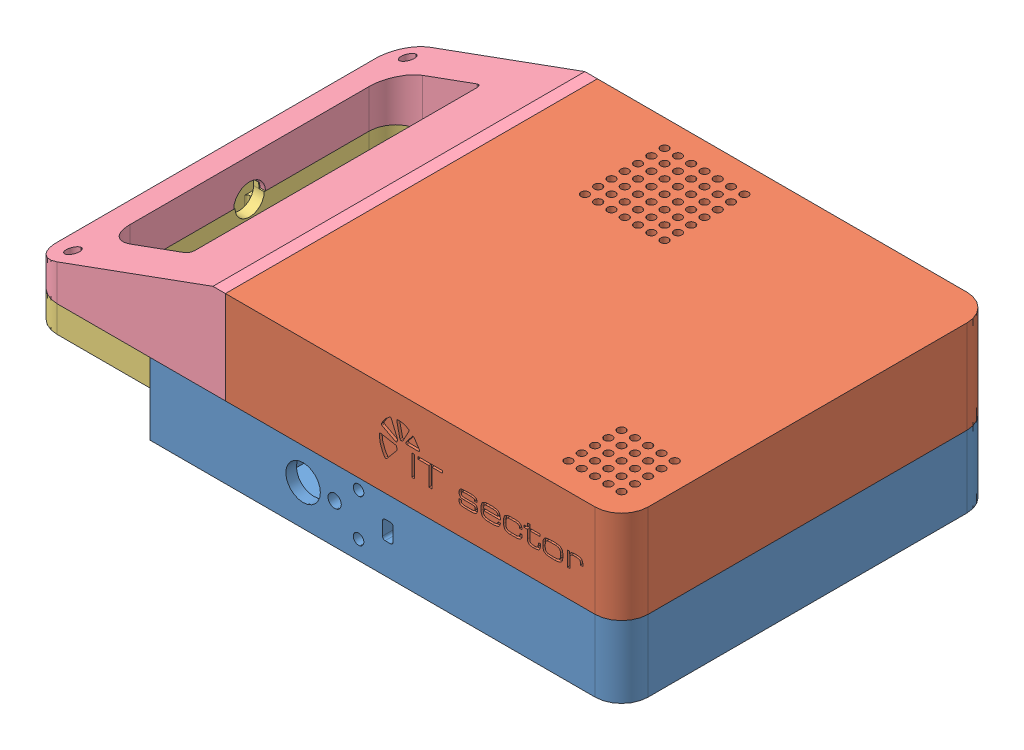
SolidWorks assembly AssemDrawBot.SLDASM, configuration Default (file format 8000). Lengths in mm.
Overall size (224 76 140).
5 component instances, 5 part files, 12 mates.
Components (placement in the parent):
- Bottomback-1: Bottomback.sldprt [Default] at origin size (185 29.03 140)
- Topback-1: Topback.sldprt [Default] at (0 7.1 0) x (1 0 0) z (0 1 0) size (149.11 140 35)
- Bottomfront-1: Bottomfront.sldprt [Default] at origin size (45 12.03 140)
- Topfront-1: Topfront.sldprt [Default] at (0 7.1 0) x (1 0 0) z (0 1 0) size (73.39 140 35)
- IRextension-1: IRextension.sldprt [Default] at (-191 -2.9 -0.25) x (1 0 0) z (0 -1 0) size (15.5 25 35)
Mates (geometry in assembly coordinates):
- Coincident1: coincident aligned: plane of Bottomback-1 through (120 7.1 70) normal (1 0 0); plane of Topback-1 through (120 42.1 60) normal (1 0 0)
- Coincident2: coincident aligned: plane of Bottomback-1 through (0 0 -70) normal (0 0 -1); plane of Topback-1 through (-92.5 42.1 -70) normal (0 0 -1)
- Coincident3: coincident anti-aligned: plane of Bottomback-1 through (-102.5 7.1 70) normal (0 1 0); plane of Topback-1 through (-92.5 7.1 60) normal (0 -1 0)
- Parallel1: parallel aligned: plane of Bottomback-1 through (120 -19.9 70) normal (0 -1 0); plane of Bottomfront-1 through (-57.5 -2.9 70) normal (0 -1 0)
- Concentric1: concentric aligned: circle of Bottomback-1; cylinder of Bottomfront-1 through (120.001 4.1 62.5) axis (-1 0 0) radius 1.5
- Coincident6: coincident anti-aligned: plane of Bottomback-1 through (-57.5 -19.91 -70) normal (-1 0 0); plane of Bottomfront-1 through (-57.5 -19.91 -70) normal (1 0 0)
- Coincident7: coincident anti-aligned: plane of Topback-1 through (-29.1078 42.11 -70) normal (-1 0 0); plane of Topfront-1 through (-29.1078 42.11 -70) normal (1 0 0)
- Parallel2: parallel anti-aligned: plane of Topback-1 through (-92.5 42.1 70) normal (0 0 1); plane of Topfront-1 through (-92.5 42.1 -70) normal (0 0 -1)
- Coincident9: coincident aligned: cylinder of Topback-1 through (-102.501 23.1 61) axis (1 0 0) radius 1.5; circle of Topfront-1
- Coincident10: coincident anti-aligned: plane of Bottomfront-1 through (-57.5 -2.9 70) normal (0 -1 0); plane of IRextension-1 through (-191 -2.9 -0.25) normal (0 1 0)
- Coincident12: coincident: moEndPointRef_w of Bottomfront-1; moEndPointRef_w of IRextension-1
- Parallel3: parallel: plane of Bottomfront-1 through (-94 -19.901 -55) normal (-1 0 0); line of IRextension-1 through (-94.25 1.1 11.75) axis (0 0 -1)
